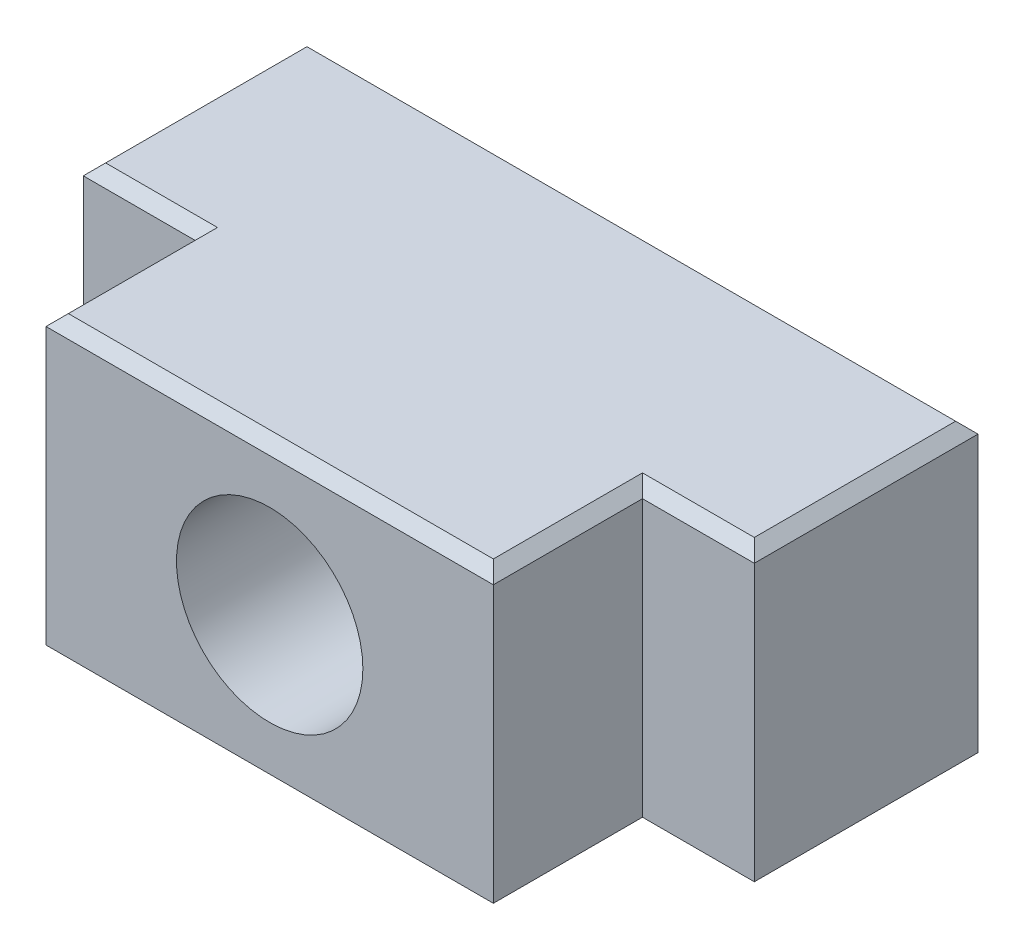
ISO-10303-21;
HEADER;
FILE_DESCRIPTION(('STEP AP214'),'2;1');
FILE_NAME('part.step','',(''),(''),'','','');
FILE_SCHEMA(('AUTOMOTIVE_DESIGN { 1 0 10303 214 1 1 1 1 }'));
ENDSEC;
DATA;
#1=APPLICATION_CONTEXT('core data for automotive mechanical design processes');
#2=APPLICATION_PROTOCOL_DEFINITION('international standard','automotive_design',2000,#1);
#3=PRODUCT_CONTEXT('',#1,'mechanical');
#4=PRODUCT('Part','Part','',(#3));
#5=PRODUCT_RELATED_PRODUCT_CATEGORY('part','',(#4));
#6=PRODUCT_DEFINITION_FORMATION('','',#4);
#7=PRODUCT_DEFINITION_CONTEXT('part definition',#1,'design');
#8=PRODUCT_DEFINITION('design','',#6,#7);
#9=PRODUCT_DEFINITION_SHAPE('','',#8);
#10=(LENGTH_UNIT() NAMED_UNIT(*) SI_UNIT(.MILLI.,.METRE.));
#11=(NAMED_UNIT(*) PLANE_ANGLE_UNIT() SI_UNIT($,.RADIAN.));
#12=(NAMED_UNIT(*) SI_UNIT($,.STERADIAN.) SOLID_ANGLE_UNIT());
#13=UNCERTAINTY_MEASURE_WITH_UNIT(LENGTH_MEASURE(1.E-05),#10,'distance_accuracy_value','');
#14=(GEOMETRIC_REPRESENTATION_CONTEXT(3) GLOBAL_UNCERTAINTY_ASSIGNED_CONTEXT((#13)) GLOBAL_UNIT_ASSIGNED_CONTEXT((#10,
#11,#12)) REPRESENTATION_CONTEXT('',''));
#15=CARTESIAN_POINT('',(0.,0.,0.));
#16=DIRECTION('',(0.,0.,1.));
#17=DIRECTION('',(1.,0.,0.));
#18=AXIS2_PLACEMENT_3D('',#15,#16,#17);
#19=CARTESIAN_POINT('',(0.,8.,0.));
#20=DIRECTION('',(0.,1.,0.));
#21=DIRECTION('',(0.,0.,1.));
#22=AXIS2_PLACEMENT_3D('',#19,#20,#21);
#23=PLANE('',#22);
#24=DIRECTION('',(0.,0.,1.));
#25=VECTOR('',#24,1.);
#26=CARTESIAN_POINT('',(-8.69999999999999,8.,0.));
#27=LINE('',#26,#25);
#28=CARTESIAN_POINT('',(-8.69999999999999,8.,0.699999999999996));
#29=VERTEX_POINT('',#28);
#30=CARTESIAN_POINT('',(-8.69999999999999,8.,-4.69999999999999));
#31=VERTEX_POINT('',#30);
#32=EDGE_CURVE('E130',#29,#31,#27,.F.);
#33=ORIENTED_EDGE('',*,*,#32,.F.);
#34=DIRECTION('',(1.,0.,0.));
#35=VECTOR('',#34,1.);
#36=CARTESIAN_POINT('',(-9.,8.,0.699999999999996));
#37=LINE('',#36,#35);
#38=CARTESIAN_POINT('',(-5.69999999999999,8.,0.699999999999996));
#39=VERTEX_POINT('',#38);
#40=EDGE_CURVE('E127',#39,#29,#37,.F.);
#41=ORIENTED_EDGE('',*,*,#40,.F.);
#42=DIRECTION('',(0.,0.,1.));
#43=VECTOR('',#42,1.);
#44=CARTESIAN_POINT('',(-5.69999999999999,8.,5.));
#45=LINE('',#44,#43);
#46=CARTESIAN_POINT('',(-5.69999999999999,8.,4.69999999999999));
#47=VERTEX_POINT('',#46);
#48=EDGE_CURVE('E222',#47,#39,#45,.F.);
#49=ORIENTED_EDGE('',*,*,#48,.F.);
#50=DIRECTION('',(1.,0.,0.));
#51=VECTOR('',#50,1.);
#52=CARTESIAN_POINT('',(0.,8.,4.69999999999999));
#53=LINE('',#52,#51);
#54=CARTESIAN_POINT('',(5.69999999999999,8.,4.69999999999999));
#55=VERTEX_POINT('',#54);
#56=EDGE_CURVE('E217',#55,#47,#53,.F.);
#57=ORIENTED_EDGE('',*,*,#56,.F.);
#58=DIRECTION('',(0.,0.,1.));
#59=VECTOR('',#58,1.);
#60=CARTESIAN_POINT('',(5.69999999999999,8.,5.));
#61=LINE('',#60,#59);
#62=CARTESIAN_POINT('',(5.69999999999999,8.,0.699999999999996));
#63=VERTEX_POINT('',#62);
#64=EDGE_CURVE('E215',#63,#55,#61,.T.);
#65=ORIENTED_EDGE('',*,*,#64,.F.);
#66=DIRECTION('',(1.,0.,0.));
#67=VECTOR('',#66,1.);
#68=CARTESIAN_POINT('',(9.,8.,0.699999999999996));
#69=LINE('',#68,#67);
#70=CARTESIAN_POINT('',(8.69999999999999,8.,0.699999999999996));
#71=VERTEX_POINT('',#70);
#72=EDGE_CURVE('E211',#71,#63,#69,.F.);
#73=ORIENTED_EDGE('',*,*,#72,.F.);
#74=DIRECTION('',(0.,0.,1.));
#75=VECTOR('',#74,1.);
#76=CARTESIAN_POINT('',(8.69999999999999,8.,0.));
#77=LINE('',#76,#75);
#78=CARTESIAN_POINT('',(8.69999999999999,8.,-4.69999999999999));
#79=VERTEX_POINT('',#78);
#80=EDGE_CURVE('E207',#79,#71,#77,.T.);
#81=ORIENTED_EDGE('',*,*,#80,.F.);
#82=DIRECTION('',(1.,0.,0.));
#83=VECTOR('',#82,1.);
#84=CARTESIAN_POINT('',(0.,8.,-4.69999999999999));
#85=LINE('',#84,#83);
#86=EDGE_CURVE('E132',#31,#79,#85,.T.);
#87=ORIENTED_EDGE('',*,*,#86,.F.);
#88=EDGE_LOOP('',(#33,#41,#49,#57,#65,#73,#81,#87));
#89=FACE_BOUND('',#88,.T.);
#90=ADVANCED_FACE('F17',(#89),#23,.T.);
#91=CARTESIAN_POINT('',(-8.69999999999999,8.,0.));
#92=DIRECTION('',(-0.707106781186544,0.707106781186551,0.));
#93=DIRECTION('',(-0.707106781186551,-0.707106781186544,0.));
#94=AXIS2_PLACEMENT_3D('',#91,#92,#93);
#95=PLANE('',#94);
#96=DIRECTION('',(-0.577350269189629,-0.577350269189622,0.577350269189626));
#97=VECTOR('',#96,1.);
#98=CARTESIAN_POINT('',(-8.69999999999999,8.,0.699999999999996));
#99=LINE('',#98,#97);
#100=CARTESIAN_POINT('',(-9.,7.69999999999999,1.));
#101=VERTEX_POINT('',#100);
#102=EDGE_CURVE('E137',#29,#101,#99,.T.);
#103=ORIENTED_EDGE('',*,*,#102,.F.);
#104=ORIENTED_EDGE('',*,*,#32,.T.);
#105=DIRECTION('',(0.577350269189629,0.577350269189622,0.577350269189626));
#106=VECTOR('',#105,1.);
#107=CARTESIAN_POINT('',(-9.,7.69999999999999,-5.));
#108=LINE('',#107,#106);
#109=CARTESIAN_POINT('',(-9.,7.69999999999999,-5.));
#110=VERTEX_POINT('',#109);
#111=EDGE_CURVE('E201',#110,#31,#108,.T.);
#112=ORIENTED_EDGE('',*,*,#111,.F.);
#113=DIRECTION('',(0.,0.,-1.));
#114=VECTOR('',#113,1.);
#115=CARTESIAN_POINT('',(-9.,7.69999999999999,-5.));
#116=LINE('',#115,#114);
#117=EDGE_CURVE('E148',#110,#101,#116,.F.);
#118=ORIENTED_EDGE('',*,*,#117,.T.);
#119=EDGE_LOOP('',(#103,#104,#112,#118));
#120=FACE_BOUND('',#119,.T.);
#121=ADVANCED_FACE('F147',(#120),#95,.T.);
#122=CARTESIAN_POINT('',(-9.,7.69999999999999,1.));
#123=DIRECTION('',(0.,0.70710678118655,0.707106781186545));
#124=DIRECTION('',(0.,-0.707106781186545,0.70710678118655));
#125=AXIS2_PLACEMENT_3D('',#122,#123,#124);
#126=PLANE('',#125);
#127=DIRECTION('',(-0.577350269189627,-0.577350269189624,0.577350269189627));
#128=VECTOR('',#127,1.);
#129=CARTESIAN_POINT('',(-5.69999999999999,8.,0.699999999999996));
#130=LINE('',#129,#128);
#131=CARTESIAN_POINT('',(-6.,7.69999999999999,1.));
#132=VERTEX_POINT('',#131);
#133=EDGE_CURVE('E144',#39,#132,#130,.T.);
#134=ORIENTED_EDGE('',*,*,#133,.F.);
#135=ORIENTED_EDGE('',*,*,#40,.T.);
#136=ORIENTED_EDGE('',*,*,#102,.T.);
#137=DIRECTION('',(-1.,0.,0.));
#138=VECTOR('',#137,1.);
#139=CARTESIAN_POINT('',(-9.,7.69999999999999,1.));
#140=LINE('',#139,#138);
#141=EDGE_CURVE('E197',#101,#132,#140,.F.);
#142=ORIENTED_EDGE('',*,*,#141,.T.);
#143=EDGE_LOOP('',(#134,#135,#136,#142));
#144=FACE_BOUND('',#143,.T.);
#145=ADVANCED_FACE('F141',(#144),#126,.T.);
#146=CARTESIAN_POINT('',(-6.,7.69999999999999,5.));
#147=DIRECTION('',(-0.707106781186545,0.70710678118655,0.));
#148=DIRECTION('',(-0.70710678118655,-0.707106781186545,0.));
#149=AXIS2_PLACEMENT_3D('',#146,#147,#148);
#150=PLANE('',#149);
#151=DIRECTION('',(-0.577350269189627,-0.577350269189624,0.577350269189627));
#152=VECTOR('',#151,1.);
#153=CARTESIAN_POINT('',(-5.69999999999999,8.,4.69999999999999));
#154=LINE('',#153,#152);
#155=CARTESIAN_POINT('',(-6.,7.69999999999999,5.));
#156=VERTEX_POINT('',#155);
#157=EDGE_CURVE('E220',#47,#156,#154,.T.);
#158=ORIENTED_EDGE('',*,*,#157,.F.);
#159=ORIENTED_EDGE('',*,*,#48,.T.);
#160=ORIENTED_EDGE('',*,*,#133,.T.);
#161=DIRECTION('',(0.,0.,-1.));
#162=VECTOR('',#161,1.);
#163=CARTESIAN_POINT('',(-6.,7.69999999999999,5.));
#164=LINE('',#163,#162);
#165=EDGE_CURVE('E192',#132,#156,#164,.F.);
#166=ORIENTED_EDGE('',*,*,#165,.T.);
#167=EDGE_LOOP('',(#158,#159,#160,#166));
#168=FACE_BOUND('',#167,.T.);
#169=ADVANCED_FACE('F226',(#168),#150,.T.);
#170=CARTESIAN_POINT('',(0.,8.,4.69999999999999));
#171=DIRECTION('',(0.,0.70710678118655,0.707106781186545));
#172=DIRECTION('',(0.,-0.707106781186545,0.70710678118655));
#173=AXIS2_PLACEMENT_3D('',#170,#171,#172);
#174=PLANE('',#173);
#175=DIRECTION('',(0.577350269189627,-0.577350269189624,0.577350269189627));
#176=VECTOR('',#175,1.);
#177=CARTESIAN_POINT('',(5.69999999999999,8.,4.69999999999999));
#178=LINE('',#177,#176);
#179=CARTESIAN_POINT('',(6.,7.69999999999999,5.));
#180=VERTEX_POINT('',#179);
#181=EDGE_CURVE('E213',#55,#180,#178,.T.);
#182=ORIENTED_EDGE('',*,*,#181,.F.);
#183=ORIENTED_EDGE('',*,*,#56,.T.);
#184=ORIENTED_EDGE('',*,*,#157,.T.);
#185=DIRECTION('',(-1.,0.,0.));
#186=VECTOR('',#185,1.);
#187=CARTESIAN_POINT('',(-9.,7.69999999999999,5.));
#188=LINE('',#187,#186);
#189=EDGE_CURVE('E186',#156,#180,#188,.F.);
#190=ORIENTED_EDGE('',*,*,#189,.T.);
#191=EDGE_LOOP('',(#182,#183,#184,#190));
#192=FACE_BOUND('',#191,.T.);
#193=ADVANCED_FACE('F344',(#192),#174,.T.);
#194=CARTESIAN_POINT('',(6.,7.69999999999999,5.));
#195=DIRECTION('',(0.707106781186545,0.70710678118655,0.));
#196=DIRECTION('',(-0.70710678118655,0.707106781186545,0.));
#197=AXIS2_PLACEMENT_3D('',#194,#195,#196);
#198=PLANE('',#197);
#199=ORIENTED_EDGE('',*,*,#181,.T.);
#200=DIRECTION('',(0.,0.,1.));
#201=VECTOR('',#200,1.);
#202=CARTESIAN_POINT('',(6.,7.69999999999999,5.));
#203=LINE('',#202,#201);
#204=CARTESIAN_POINT('',(6.,7.69999999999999,1.));
#205=VERTEX_POINT('',#204);
#206=EDGE_CURVE('E180',#180,#205,#203,.F.);
#207=ORIENTED_EDGE('',*,*,#206,.T.);
#208=DIRECTION('',(0.577350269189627,-0.577350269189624,0.577350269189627));
#209=VECTOR('',#208,1.);
#210=CARTESIAN_POINT('',(5.69999999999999,8.,0.699999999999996));
#211=LINE('',#210,#209);
#212=EDGE_CURVE('E209',#63,#205,#211,.T.);
#213=ORIENTED_EDGE('',*,*,#212,.F.);
#214=ORIENTED_EDGE('',*,*,#64,.T.);
#215=EDGE_LOOP('',(#199,#207,#213,#214));
#216=FACE_BOUND('',#215,.T.);
#217=ADVANCED_FACE('F351',(#216),#198,.T.);
#218=CARTESIAN_POINT('',(9.,7.69999999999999,1.));
#219=DIRECTION('',(0.,0.70710678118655,0.707106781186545));
#220=DIRECTION('',(0.,-0.707106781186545,0.70710678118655));
#221=AXIS2_PLACEMENT_3D('',#218,#219,#220);
#222=PLANE('',#221);
#223=ORIENTED_EDGE('',*,*,#212,.T.);
#224=DIRECTION('',(-1.,0.,0.));
#225=VECTOR('',#224,1.);
#226=CARTESIAN_POINT('',(9.,7.69999999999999,1.));
#227=LINE('',#226,#225);
#228=CARTESIAN_POINT('',(9.,7.69999999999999,1.));
#229=VERTEX_POINT('',#228);
#230=EDGE_CURVE('E174',#205,#229,#227,.F.);
#231=ORIENTED_EDGE('',*,*,#230,.T.);
#232=DIRECTION('',(0.577350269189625,-0.577350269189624,0.577350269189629));
#233=VECTOR('',#232,1.);
#234=CARTESIAN_POINT('',(8.69999999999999,8.,0.699999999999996));
#235=LINE('',#234,#233);
#236=EDGE_CURVE('E205',#71,#229,#235,.T.);
#237=ORIENTED_EDGE('',*,*,#236,.F.);
#238=ORIENTED_EDGE('',*,*,#72,.T.);
#239=EDGE_LOOP('',(#223,#231,#237,#238));
#240=FACE_BOUND('',#239,.T.);
#241=ADVANCED_FACE('F354',(#240),#222,.T.);
#242=CARTESIAN_POINT('',(8.69999999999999,8.,0.));
#243=DIRECTION('',(0.707106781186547,0.707106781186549,0.));
#244=DIRECTION('',(-0.707106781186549,0.707106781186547,0.));
#245=AXIS2_PLACEMENT_3D('',#242,#243,#244);
#246=PLANE('',#245);
#247=ORIENTED_EDGE('',*,*,#236,.T.);
#248=DIRECTION('',(0.,0.,1.));
#249=VECTOR('',#248,1.);
#250=CARTESIAN_POINT('',(9.,7.69999999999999,-5.));
#251=LINE('',#250,#249);
#252=CARTESIAN_POINT('',(9.,7.69999999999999,-5.));
#253=VERTEX_POINT('',#252);
#254=EDGE_CURVE('E162',#229,#253,#251,.F.);
#255=ORIENTED_EDGE('',*,*,#254,.T.);
#256=DIRECTION('',(0.577350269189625,-0.577350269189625,-0.577350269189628));
#257=VECTOR('',#256,1.);
#258=CARTESIAN_POINT('',(8.69999999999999,8.,-4.69999999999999));
#259=LINE('',#258,#257);
#260=EDGE_CURVE('E203',#79,#253,#259,.T.);
#261=ORIENTED_EDGE('',*,*,#260,.F.);
#262=ORIENTED_EDGE('',*,*,#80,.T.);
#263=EDGE_LOOP('',(#247,#255,#261,#262));
#264=FACE_BOUND('',#263,.T.);
#265=ADVANCED_FACE('F397',(#264),#246,.T.);
#266=CARTESIAN_POINT('',(0.,4.,-5.));
#267=DIRECTION('',(0.,0.,1.));
#268=DIRECTION('',(1.,0.,0.));
#269=AXIS2_PLACEMENT_3D('',#266,#267,#268);
#270=CYLINDRICAL_SURFACE('',#269,2.5);
#271=CARTESIAN_POINT('',(0.,4.,-5.));
#272=DIRECTION('',(0.,0.,1.));
#273=DIRECTION('',(1.,0.,0.));
#274=AXIS2_PLACEMENT_3D('',#271,#272,#273);
#275=CIRCLE('',#274,2.5);
#276=CARTESIAN_POINT('',(2.5,4.,-5.));
#277=VERTEX_POINT('',#276);
#278=EDGE_CURVE('E152',#277,#277,#275,.F.);
#279=ORIENTED_EDGE('',*,*,#278,.T.);
#280=EDGE_LOOP('',(#279));
#281=FACE_BOUND('',#280,.T.);
#282=CARTESIAN_POINT('',(0.,4.,5.));
#283=DIRECTION('',(0.,0.,1.));
#284=DIRECTION('',(1.,0.,0.));
#285=AXIS2_PLACEMENT_3D('',#282,#283,#284);
#286=CIRCLE('',#285,2.5);
#287=CARTESIAN_POINT('',(2.5,4.,5.));
#288=VERTEX_POINT('',#287);
#289=EDGE_CURVE('E20',#288,#288,#286,.T.);
#290=ORIENTED_EDGE('',*,*,#289,.T.);
#291=EDGE_LOOP('',(#290));
#292=FACE_BOUND('',#291,.T.);
#293=ADVANCED_FACE('F401',(#281,#292),#270,.F.);
#294=CARTESIAN_POINT('',(0.,8.,-4.69999999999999));
#295=DIRECTION('',(0.,0.70710678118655,-0.707106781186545));
#296=DIRECTION('',(0.,0.707106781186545,0.70710678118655));
#297=AXIS2_PLACEMENT_3D('',#294,#295,#296);
#298=PLANE('',#297);
#299=ORIENTED_EDGE('',*,*,#111,.T.);
#300=ORIENTED_EDGE('',*,*,#86,.T.);
#301=ORIENTED_EDGE('',*,*,#260,.T.);
#302=DIRECTION('',(1.,0.,0.));
#303=VECTOR('',#302,1.);
#304=CARTESIAN_POINT('',(-9.,7.69999999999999,-5.));
#305=LINE('',#304,#303);
#306=EDGE_CURVE('E154',#253,#110,#305,.F.);
#307=ORIENTED_EDGE('',*,*,#306,.T.);
#308=EDGE_LOOP('',(#299,#300,#301,#307));
#309=FACE_BOUND('',#308,.T.);
#310=ADVANCED_FACE('F399',(#309),#298,.T.);
#311=CARTESIAN_POINT('',(-9.,8.,-5.));
#312=DIRECTION('',(1.,0.,0.));
#313=DIRECTION('',(0.,0.,-1.));
#314=AXIS2_PLACEMENT_3D('',#311,#312,#313);
#315=PLANE('',#314);
#316=DIRECTION('',(0.,0.,1.));
#317=VECTOR('',#316,1.);
#318=CARTESIAN_POINT('',(-9.,0.300000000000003,-5.));
#319=LINE('',#318,#317);
#320=CARTESIAN_POINT('',(-9.,0.300000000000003,-5.));
#321=VERTEX_POINT('',#320);
#322=CARTESIAN_POINT('',(-9.,0.300000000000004,1.));
#323=VERTEX_POINT('',#322);
#324=EDGE_CURVE('E260',#321,#323,#319,.T.);
#325=ORIENTED_EDGE('',*,*,#324,.T.);
#326=DIRECTION('',(0.,1.,0.));
#327=VECTOR('',#326,1.);
#328=CARTESIAN_POINT('',(-9.,0.,1.));
#329=LINE('',#328,#327);
#330=EDGE_CURVE('E195',#323,#101,#329,.T.);
#331=ORIENTED_EDGE('',*,*,#330,.T.);
#332=ORIENTED_EDGE('',*,*,#117,.F.);
#333=DIRECTION('',(0.,1.,0.));
#334=VECTOR('',#333,1.);
#335=CARTESIAN_POINT('',(-9.,8.,-5.));
#336=LINE('',#335,#334);
#337=EDGE_CURVE('E159',#110,#321,#336,.F.);
#338=ORIENTED_EDGE('',*,*,#337,.T.);
#339=EDGE_LOOP('',(#325,#331,#332,#338));
#340=FACE_BOUND('',#339,.T.);
#341=ADVANCED_FACE('F268',(#340),#315,.F.);
#342=CARTESIAN_POINT('',(-9.,0.,1.));
#343=DIRECTION('',(0.,0.,-1.));
#344=DIRECTION('',(-1.,0.,0.));
#345=AXIS2_PLACEMENT_3D('',#342,#343,#344);
#346=PLANE('',#345);
#347=DIRECTION('',(1.,0.,0.));
#348=VECTOR('',#347,1.);
#349=CARTESIAN_POINT('',(0.,0.300000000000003,1.));
#350=LINE('',#349,#348);
#351=CARTESIAN_POINT('',(-6.,0.300000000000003,1.));
#352=VERTEX_POINT('',#351);
#353=EDGE_CURVE('E235',#323,#352,#350,.T.);
#354=ORIENTED_EDGE('',*,*,#353,.T.);
#355=DIRECTION('',(0.,1.,0.));
#356=VECTOR('',#355,1.);
#357=CARTESIAN_POINT('',(-6.,0.,1.));
#358=LINE('',#357,#356);
#359=EDGE_CURVE('E189',#352,#132,#358,.T.);
#360=ORIENTED_EDGE('',*,*,#359,.T.);
#361=ORIENTED_EDGE('',*,*,#141,.F.);
#362=ORIENTED_EDGE('',*,*,#330,.F.);
#363=EDGE_LOOP('',(#354,#360,#361,#362));
#364=FACE_BOUND('',#363,.T.);
#365=ADVANCED_FACE('F233',(#364),#346,.F.);
#366=CARTESIAN_POINT('',(-6.,0.,5.));
#367=DIRECTION('',(1.,0.,0.));
#368=DIRECTION('',(0.,0.,-1.));
#369=AXIS2_PLACEMENT_3D('',#366,#367,#368);
#370=PLANE('',#369);
#371=DIRECTION('',(0.,0.,1.));
#372=VECTOR('',#371,1.);
#373=CARTESIAN_POINT('',(-6.,0.300000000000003,0.));
#374=LINE('',#373,#372);
#375=CARTESIAN_POINT('',(-6.,0.300000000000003,5.));
#376=VERTEX_POINT('',#375);
#377=EDGE_CURVE('E240',#352,#376,#374,.T.);
#378=ORIENTED_EDGE('',*,*,#377,.T.);
#379=DIRECTION('',(0.,1.,0.));
#380=VECTOR('',#379,1.);
#381=CARTESIAN_POINT('',(-6.,8.,5.));
#382=LINE('',#381,#380);
#383=EDGE_CURVE('E183',#376,#156,#382,.T.);
#384=ORIENTED_EDGE('',*,*,#383,.T.);
#385=ORIENTED_EDGE('',*,*,#165,.F.);
#386=ORIENTED_EDGE('',*,*,#359,.F.);
#387=EDGE_LOOP('',(#378,#384,#385,#386));
#388=FACE_BOUND('',#387,.T.);
#389=ADVANCED_FACE('F229',(#388),#370,.F.);
#390=CARTESIAN_POINT('',(-9.,8.,5.));
#391=DIRECTION('',(0.,0.,-1.));
#392=DIRECTION('',(-1.,0.,0.));
#393=AXIS2_PLACEMENT_3D('',#390,#391,#392);
#394=PLANE('',#393);
#395=DIRECTION('',(1.,0.,0.));
#396=VECTOR('',#395,1.);
#397=CARTESIAN_POINT('',(-9.,0.300000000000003,5.));
#398=LINE('',#397,#396);
#399=CARTESIAN_POINT('',(6.,0.300000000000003,5.));
#400=VERTEX_POINT('',#399);
#401=EDGE_CURVE('E251',#376,#400,#398,.T.);
#402=ORIENTED_EDGE('',*,*,#401,.T.);
#403=DIRECTION('',(0.,1.,0.));
#404=VECTOR('',#403,1.);
#405=CARTESIAN_POINT('',(6.,0.,5.));
#406=LINE('',#405,#404);
#407=EDGE_CURVE('E177',#400,#180,#406,.T.);
#408=ORIENTED_EDGE('',*,*,#407,.T.);
#409=ORIENTED_EDGE('',*,*,#189,.F.);
#410=ORIENTED_EDGE('',*,*,#383,.F.);
#411=EDGE_LOOP('',(#402,#408,#409,#410));
#412=FACE_BOUND('',#411,.T.);
#413=ORIENTED_EDGE('',*,*,#289,.F.);
#414=EDGE_LOOP('',(#413));
#415=FACE_BOUND('',#414,.T.);
#416=ADVANCED_FACE('F339',(#412,#415),#394,.F.);
#417=CARTESIAN_POINT('',(6.,0.,5.));
#418=DIRECTION('',(-1.,0.,0.));
#419=DIRECTION('',(0.,0.,1.));
#420=AXIS2_PLACEMENT_3D('',#417,#418,#419);
#421=PLANE('',#420);
#422=DIRECTION('',(0.,0.,1.));
#423=VECTOR('',#422,1.);
#424=CARTESIAN_POINT('',(6.,0.300000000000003,0.));
#425=LINE('',#424,#423);
#426=CARTESIAN_POINT('',(6.,0.300000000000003,1.));
#427=VERTEX_POINT('',#426);
#428=EDGE_CURVE('E300',#400,#427,#425,.F.);
#429=ORIENTED_EDGE('',*,*,#428,.T.);
#430=DIRECTION('',(0.,1.,0.));
#431=VECTOR('',#430,1.);
#432=CARTESIAN_POINT('',(6.,0.,1.));
#433=LINE('',#432,#431);
#434=EDGE_CURVE('E168',#427,#205,#433,.T.);
#435=ORIENTED_EDGE('',*,*,#434,.T.);
#436=ORIENTED_EDGE('',*,*,#206,.F.);
#437=ORIENTED_EDGE('',*,*,#407,.F.);
#438=EDGE_LOOP('',(#429,#435,#436,#437));
#439=FACE_BOUND('',#438,.T.);
#440=ADVANCED_FACE('F356',(#439),#421,.F.);
#441=CARTESIAN_POINT('',(9.,0.,1.));
#442=DIRECTION('',(0.,0.,-1.));
#443=DIRECTION('',(-1.,0.,0.));
#444=AXIS2_PLACEMENT_3D('',#441,#442,#443);
#445=PLANE('',#444);
#446=DIRECTION('',(1.,0.,0.));
#447=VECTOR('',#446,1.);
#448=CARTESIAN_POINT('',(0.,0.300000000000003,1.));
#449=LINE('',#448,#447);
#450=CARTESIAN_POINT('',(9.,0.300000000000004,1.));
#451=VERTEX_POINT('',#450);
#452=EDGE_CURVE('E295',#427,#451,#449,.T.);
#453=ORIENTED_EDGE('',*,*,#452,.T.);
#454=DIRECTION('',(0.,1.,0.));
#455=VECTOR('',#454,1.);
#456=CARTESIAN_POINT('',(9.,8.,1.));
#457=LINE('',#456,#455);
#458=EDGE_CURVE('E155',#451,#229,#457,.T.);
#459=ORIENTED_EDGE('',*,*,#458,.T.);
#460=ORIENTED_EDGE('',*,*,#230,.F.);
#461=ORIENTED_EDGE('',*,*,#434,.F.);
#462=EDGE_LOOP('',(#453,#459,#460,#461));
#463=FACE_BOUND('',#462,.T.);
#464=ADVANCED_FACE('F355',(#463),#445,.F.);
#465=CARTESIAN_POINT('',(9.,8.,-5.));
#466=DIRECTION('',(-1.,0.,0.));
#467=DIRECTION('',(0.,0.,1.));
#468=AXIS2_PLACEMENT_3D('',#465,#466,#467);
#469=PLANE('',#468);
#470=DIRECTION('',(0.,0.,1.));
#471=VECTOR('',#470,1.);
#472=CARTESIAN_POINT('',(9.,0.300000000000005,-5.));
#473=LINE('',#472,#471);
#474=CARTESIAN_POINT('',(9.,0.300000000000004,-5.));
#475=VERTEX_POINT('',#474);
#476=EDGE_CURVE('E290',#451,#475,#473,.F.);
#477=ORIENTED_EDGE('',*,*,#476,.T.);
#478=DIRECTION('',(0.,1.,0.));
#479=VECTOR('',#478,1.);
#480=CARTESIAN_POINT('',(9.,8.,-5.));
#481=LINE('',#480,#479);
#482=EDGE_CURVE('E262',#475,#253,#481,.T.);
#483=ORIENTED_EDGE('',*,*,#482,.T.);
#484=ORIENTED_EDGE('',*,*,#254,.F.);
#485=ORIENTED_EDGE('',*,*,#458,.F.);
#486=EDGE_LOOP('',(#477,#483,#484,#485));
#487=FACE_BOUND('',#486,.T.);
#488=ADVANCED_FACE('F364',(#487),#469,.F.);
#489=CARTESIAN_POINT('',(-9.,8.,-5.));
#490=DIRECTION('',(0.,0.,1.));
#491=DIRECTION('',(1.,0.,0.));
#492=AXIS2_PLACEMENT_3D('',#489,#490,#491);
#493=PLANE('',#492);
#494=DIRECTION('',(1.,0.,0.));
#495=VECTOR('',#494,1.);
#496=CARTESIAN_POINT('',(-9.,0.300000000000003,-5.));
#497=LINE('',#496,#495);
#498=EDGE_CURVE('E275',#475,#321,#497,.F.);
#499=ORIENTED_EDGE('',*,*,#498,.T.);
#500=ORIENTED_EDGE('',*,*,#337,.F.);
#501=ORIENTED_EDGE('',*,*,#306,.F.);
#502=ORIENTED_EDGE('',*,*,#482,.F.);
#503=EDGE_LOOP('',(#499,#500,#501,#502));
#504=FACE_BOUND('',#503,.T.);
#505=ORIENTED_EDGE('',*,*,#278,.F.);
#506=EDGE_LOOP('',(#505));
#507=FACE_BOUND('',#506,.T.);
#508=ADVANCED_FACE('F280',(#504,#507),#493,.F.);
#509=CARTESIAN_POINT('',(-9.,0.300000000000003,-5.));
#510=DIRECTION('',(0.707106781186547,0.707106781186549,0.));
#511=DIRECTION('',(-0.707106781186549,0.707106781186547,0.));
#512=AXIS2_PLACEMENT_3D('',#509,#510,#511);
#513=PLANE('',#512);
#514=ORIENTED_EDGE('',*,*,#324,.F.);
#515=DIRECTION('',(0.577350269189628,-0.577350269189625,0.577350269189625));
#516=VECTOR('',#515,1.);
#517=CARTESIAN_POINT('',(-9.,0.300000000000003,-5.));
#518=LINE('',#517,#516);
#519=CARTESIAN_POINT('',(-8.7,0.,-4.69999999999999));
#520=VERTEX_POINT('',#519);
#521=EDGE_CURVE('E273',#321,#520,#518,.T.);
#522=ORIENTED_EDGE('',*,*,#521,.T.);
#523=DIRECTION('',(0.,0.,1.));
#524=VECTOR('',#523,1.);
#525=CARTESIAN_POINT('',(-8.7,0.,0.));
#526=LINE('',#525,#524);
#527=CARTESIAN_POINT('',(-8.7,0.,0.699999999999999));
#528=VERTEX_POINT('',#527);
#529=EDGE_CURVE('E278',#520,#528,#526,.T.);
#530=ORIENTED_EDGE('',*,*,#529,.T.);
#531=DIRECTION('',(-0.577350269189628,0.577350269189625,0.577350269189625));
#532=VECTOR('',#531,1.);
#533=CARTESIAN_POINT('',(-8.7,0.,0.699999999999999));
#534=LINE('',#533,#532);
#535=EDGE_CURVE('E241',#528,#323,#534,.T.);
#536=ORIENTED_EDGE('',*,*,#535,.T.);
#537=EDGE_LOOP('',(#514,#522,#530,#536));
#538=FACE_BOUND('',#537,.T.);
#539=ADVANCED_FACE('F324',(#538),#513,.F.);
#540=CARTESIAN_POINT('',(0.,0.,0.699999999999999));
#541=DIRECTION('',(0.,0.707106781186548,-0.707106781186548));
#542=DIRECTION('',(0.,0.707106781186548,0.707106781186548));
#543=AXIS2_PLACEMENT_3D('',#540,#541,#542);
#544=PLANE('',#543);
#545=ORIENTED_EDGE('',*,*,#353,.F.);
#546=ORIENTED_EDGE('',*,*,#535,.F.);
#547=DIRECTION('',(1.,0.,0.));
#548=VECTOR('',#547,1.);
#549=CARTESIAN_POINT('',(0.,0.,0.699999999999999));
#550=LINE('',#549,#548);
#551=CARTESIAN_POINT('',(-5.7,0.,0.699999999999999));
#552=VERTEX_POINT('',#551);
#553=EDGE_CURVE('E247',#528,#552,#550,.T.);
#554=ORIENTED_EDGE('',*,*,#553,.T.);
#555=DIRECTION('',(-0.577350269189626,0.577350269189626,0.577350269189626));
#556=VECTOR('',#555,1.);
#557=CARTESIAN_POINT('',(-5.7,0.,0.7));
#558=LINE('',#557,#556);
#559=EDGE_CURVE('E244',#552,#352,#558,.T.);
#560=ORIENTED_EDGE('',*,*,#559,.T.);
#561=EDGE_LOOP('',(#545,#546,#554,#560));
#562=FACE_BOUND('',#561,.T.);
#563=ADVANCED_FACE('F245',(#562),#544,.F.);
#564=CARTESIAN_POINT('',(-5.7,0.,0.));
#565=DIRECTION('',(0.707106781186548,0.707106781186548,0.));
#566=DIRECTION('',(-0.707106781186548,0.707106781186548,0.));
#567=AXIS2_PLACEMENT_3D('',#564,#565,#566);
#568=PLANE('',#567);
#569=DIRECTION('',(0.,0.,1.));
#570=VECTOR('',#569,1.);
#571=CARTESIAN_POINT('',(-5.7,0.,0.));
#572=LINE('',#571,#570);
#573=CARTESIAN_POINT('',(-5.7,0.,4.7));
#574=VERTEX_POINT('',#573);
#575=EDGE_CURVE('E304',#552,#574,#572,.T.);
#576=ORIENTED_EDGE('',*,*,#575,.T.);
#577=DIRECTION('',(-0.577350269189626,0.577350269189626,0.577350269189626));
#578=VECTOR('',#577,1.);
#579=CARTESIAN_POINT('',(-5.69999999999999,0.,4.69999999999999));
#580=LINE('',#579,#578);
#581=EDGE_CURVE('E254',#574,#376,#580,.T.);
#582=ORIENTED_EDGE('',*,*,#581,.T.);
#583=ORIENTED_EDGE('',*,*,#377,.F.);
#584=ORIENTED_EDGE('',*,*,#559,.F.);
#585=EDGE_LOOP('',(#576,#582,#583,#584));
#586=FACE_BOUND('',#585,.T.);
#587=ADVANCED_FACE('F303',(#586),#568,.F.);
#588=CARTESIAN_POINT('',(-9.,0.300000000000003,5.));
#589=DIRECTION('',(0.,0.707106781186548,-0.707106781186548));
#590=DIRECTION('',(0.,0.707106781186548,0.707106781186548));
#591=AXIS2_PLACEMENT_3D('',#588,#589,#590);
#592=PLANE('',#591);
#593=DIRECTION('',(1.,0.,0.));
#594=VECTOR('',#593,1.);
#595=CARTESIAN_POINT('',(0.,0.,4.69999999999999));
#596=LINE('',#595,#594);
#597=CARTESIAN_POINT('',(5.7,0.,4.7));
#598=VERTEX_POINT('',#597);
#599=EDGE_CURVE('E310',#574,#598,#596,.T.);
#600=ORIENTED_EDGE('',*,*,#599,.T.);
#601=DIRECTION('',(0.577350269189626,0.577350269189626,0.577350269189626));
#602=VECTOR('',#601,1.);
#603=CARTESIAN_POINT('',(5.7,0.,4.7));
#604=LINE('',#603,#602);
#605=EDGE_CURVE('E297',#598,#400,#604,.T.);
#606=ORIENTED_EDGE('',*,*,#605,.T.);
#607=ORIENTED_EDGE('',*,*,#401,.F.);
#608=ORIENTED_EDGE('',*,*,#581,.F.);
#609=EDGE_LOOP('',(#600,#606,#607,#608));
#610=FACE_BOUND('',#609,.T.);
#611=ADVANCED_FACE('F309',(#610),#592,.F.);
#612=CARTESIAN_POINT('',(5.7,0.,0.));
#613=DIRECTION('',(-0.707106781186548,0.707106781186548,0.));
#614=DIRECTION('',(-0.707106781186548,-0.707106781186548,0.));
#615=AXIS2_PLACEMENT_3D('',#612,#613,#614);
#616=PLANE('',#615);
#617=DIRECTION('',(0.,0.,1.));
#618=VECTOR('',#617,1.);
#619=CARTESIAN_POINT('',(5.7,0.,0.));
#620=LINE('',#619,#618);
#621=CARTESIAN_POINT('',(5.7,0.,0.7));
#622=VERTEX_POINT('',#621);
#623=EDGE_CURVE('E317',#598,#622,#620,.F.);
#624=ORIENTED_EDGE('',*,*,#623,.T.);
#625=DIRECTION('',(0.577350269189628,0.577350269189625,0.577350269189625));
#626=VECTOR('',#625,1.);
#627=CARTESIAN_POINT('',(5.7,0.,0.7));
#628=LINE('',#627,#626);
#629=EDGE_CURVE('E292',#622,#427,#628,.T.);
#630=ORIENTED_EDGE('',*,*,#629,.T.);
#631=ORIENTED_EDGE('',*,*,#428,.F.);
#632=ORIENTED_EDGE('',*,*,#605,.F.);
#633=EDGE_LOOP('',(#624,#630,#631,#632));
#634=FACE_BOUND('',#633,.T.);
#635=ADVANCED_FACE('F335',(#634),#616,.F.);
#636=CARTESIAN_POINT('',(0.,0.,0.700000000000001));
#637=DIRECTION('',(0.,0.707106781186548,-0.707106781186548));
#638=DIRECTION('',(0.,0.707106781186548,0.707106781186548));
#639=AXIS2_PLACEMENT_3D('',#636,#637,#638);
#640=PLANE('',#639);
#641=DIRECTION('',(1.,0.,0.));
#642=VECTOR('',#641,1.);
#643=CARTESIAN_POINT('',(0.,0.,0.7));
#644=LINE('',#643,#642);
#645=CARTESIAN_POINT('',(8.7,0.,0.699999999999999));
#646=VERTEX_POINT('',#645);
#647=EDGE_CURVE('E319',#622,#646,#644,.T.);
#648=ORIENTED_EDGE('',*,*,#647,.T.);
#649=DIRECTION('',(0.577350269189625,0.577350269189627,0.577350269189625));
#650=VECTOR('',#649,1.);
#651=CARTESIAN_POINT('',(8.7,0.,0.699999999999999));
#652=LINE('',#651,#650);
#653=EDGE_CURVE('E284',#646,#451,#652,.T.);
#654=ORIENTED_EDGE('',*,*,#653,.T.);
#655=ORIENTED_EDGE('',*,*,#452,.F.);
#656=ORIENTED_EDGE('',*,*,#629,.F.);
#657=EDGE_LOOP('',(#648,#654,#655,#656));
#658=FACE_BOUND('',#657,.T.);
#659=ADVANCED_FACE('F332',(#658),#640,.F.);
#660=CARTESIAN_POINT('',(9.,0.300000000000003,-5.));
#661=DIRECTION('',(-0.707106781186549,0.707106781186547,0.));
#662=DIRECTION('',(-0.707106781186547,-0.707106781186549,0.));
#663=AXIS2_PLACEMENT_3D('',#660,#661,#662);
#664=PLANE('',#663);
#665=DIRECTION('',(0.,0.,1.));
#666=VECTOR('',#665,1.);
#667=CARTESIAN_POINT('',(8.7,0.,0.));
#668=LINE('',#667,#666);
#669=CARTESIAN_POINT('',(8.7,0.,-4.69999999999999));
#670=VERTEX_POINT('',#669);
#671=EDGE_CURVE('E26',#646,#670,#668,.F.);
#672=ORIENTED_EDGE('',*,*,#671,.T.);
#673=DIRECTION('',(0.577350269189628,0.577350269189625,-0.577350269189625));
#674=VECTOR('',#673,1.);
#675=CARTESIAN_POINT('',(8.7,0.,-4.69999999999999));
#676=LINE('',#675,#674);
#677=EDGE_CURVE('E34',#670,#475,#676,.T.);
#678=ORIENTED_EDGE('',*,*,#677,.T.);
#679=ORIENTED_EDGE('',*,*,#476,.F.);
#680=ORIENTED_EDGE('',*,*,#653,.F.);
#681=EDGE_LOOP('',(#672,#678,#679,#680));
#682=FACE_BOUND('',#681,.T.);
#683=ADVANCED_FACE('F328',(#682),#664,.F.);
#684=CARTESIAN_POINT('',(-9.,0.300000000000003,-5.));
#685=DIRECTION('',(0.,0.707106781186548,0.707106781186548));
#686=DIRECTION('',(0.,-0.707106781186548,0.707106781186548));
#687=AXIS2_PLACEMENT_3D('',#684,#685,#686);
#688=PLANE('',#687);
#689=ORIENTED_EDGE('',*,*,#498,.F.);
#690=ORIENTED_EDGE('',*,*,#677,.F.);
#691=DIRECTION('',(1.,0.,0.));
#692=VECTOR('',#691,1.);
#693=CARTESIAN_POINT('',(0.,0.,-4.69999999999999));
#694=LINE('',#693,#692);
#695=EDGE_CURVE('E11',#670,#520,#694,.F.);
#696=ORIENTED_EDGE('',*,*,#695,.T.);
#697=ORIENTED_EDGE('',*,*,#521,.F.);
#698=EDGE_LOOP('',(#689,#690,#696,#697));
#699=FACE_BOUND('',#698,.T.);
#700=ADVANCED_FACE('F274',(#699),#688,.F.);
#701=CARTESIAN_POINT('',(0.,0.,0.));
#702=DIRECTION('',(0.,1.,0.));
#703=DIRECTION('',(0.,0.,1.));
#704=AXIS2_PLACEMENT_3D('',#701,#702,#703);
#705=PLANE('',#704);
#706=ORIENTED_EDGE('',*,*,#671,.F.);
#707=ORIENTED_EDGE('',*,*,#647,.F.);
#708=ORIENTED_EDGE('',*,*,#623,.F.);
#709=ORIENTED_EDGE('',*,*,#599,.F.);
#710=ORIENTED_EDGE('',*,*,#575,.F.);
#711=ORIENTED_EDGE('',*,*,#553,.F.);
#712=ORIENTED_EDGE('',*,*,#529,.F.);
#713=ORIENTED_EDGE('',*,*,#695,.F.);
#714=EDGE_LOOP('',(#706,#707,#708,#709,#710,#711,#712,#713));
#715=FACE_BOUND('',#714,.T.);
#716=ADVANCED_FACE('F314',(#715),#705,.F.);
#717=CLOSED_SHELL('',(#90,#121,#145,#169,#193,#217,#241,#265,#293,#310,#341,#365,#389,#416,#440,
#464,#488,#508,#539,#563,#587,#611,#635,#659,#683,#700,#716));
#718=MANIFOLD_SOLID_BREP('B1',#717);
#719=ADVANCED_BREP_SHAPE_REPRESENTATION('',(#18,#718),#14);
#720=SHAPE_DEFINITION_REPRESENTATION(#9,#719);
ENDSEC;
END-ISO-10303-21;
